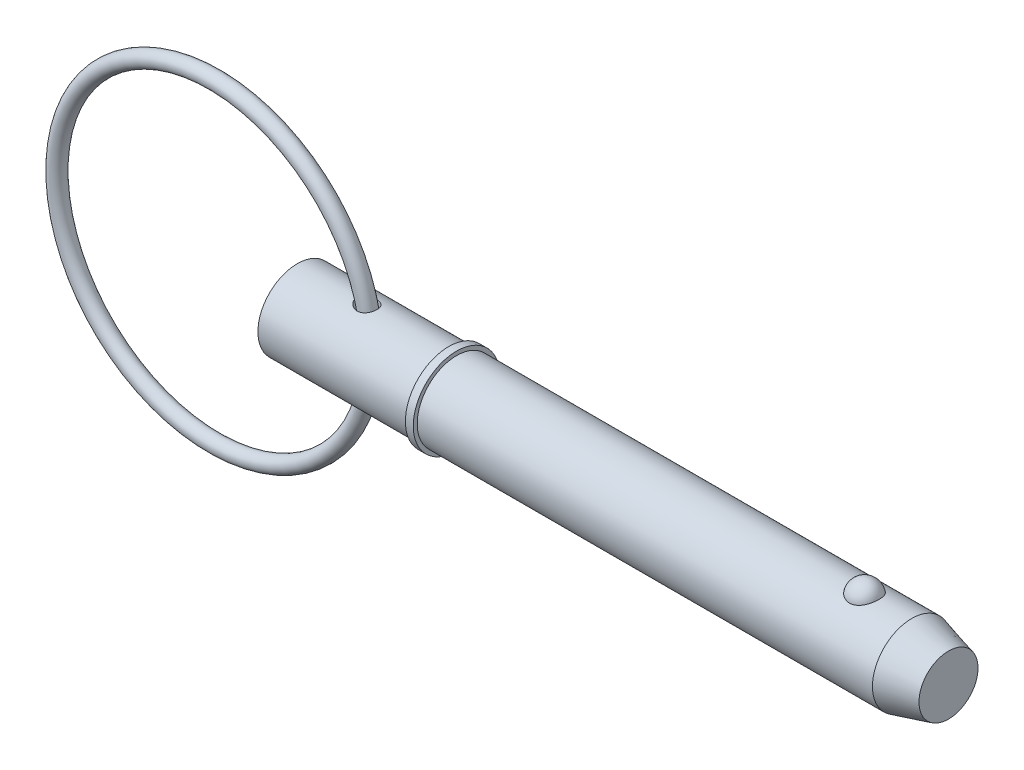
ISO-10303-21;
HEADER;
FILE_DESCRIPTION(('STEP AP214'),'2;1');
FILE_NAME('part.step','',(''),(''),'','','');
FILE_SCHEMA(('AUTOMOTIVE_DESIGN { 1 0 10303 214 1 1 1 1 }'));
ENDSEC;
DATA;
#1=APPLICATION_CONTEXT('core data for automotive mechanical design processes');
#2=APPLICATION_PROTOCOL_DEFINITION('international standard','automotive_design',2000,#1);
#3=PRODUCT_CONTEXT('',#1,'mechanical');
#4=PRODUCT('Part','Part','',(#3));
#5=PRODUCT_RELATED_PRODUCT_CATEGORY('part','',(#4));
#6=PRODUCT_DEFINITION_FORMATION('','',#4);
#7=PRODUCT_DEFINITION_CONTEXT('part definition',#1,'design');
#8=PRODUCT_DEFINITION('design','',#6,#7);
#9=PRODUCT_DEFINITION_SHAPE('','',#8);
#10=(LENGTH_UNIT() NAMED_UNIT(*) SI_UNIT(.MILLI.,.METRE.));
#11=(NAMED_UNIT(*) PLANE_ANGLE_UNIT() SI_UNIT($,.RADIAN.));
#12=(NAMED_UNIT(*) SI_UNIT($,.STERADIAN.) SOLID_ANGLE_UNIT());
#13=UNCERTAINTY_MEASURE_WITH_UNIT(LENGTH_MEASURE(1.E-05),#10,'distance_accuracy_value','');
#14=(GEOMETRIC_REPRESENTATION_CONTEXT(3) GLOBAL_UNCERTAINTY_ASSIGNED_CONTEXT((#13)) GLOBAL_UNIT_ASSIGNED_CONTEXT((#10,
#11,#12)) REPRESENTATION_CONTEXT('',''));
#15=CARTESIAN_POINT('',(0.,0.,0.));
#16=DIRECTION('',(0.,0.,1.));
#17=DIRECTION('',(1.,0.,0.));
#18=AXIS2_PLACEMENT_3D('',#15,#16,#17);
#19=CARTESIAN_POINT('',(-13.3798047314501,0.,0.));
#20=DIRECTION('',(0.,0.,1.));
#21=DIRECTION('',(1.,0.,0.));
#22=AXIS2_PLACEMENT_3D('',#19,#20,#21);
#23=TOROIDAL_SURFACE('',#22,25.4,1.27);
#24=CARTESIAN_POINT('',(13.2901952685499,0.,0.));
#25=VERTEX_POINT('',#24);
#26=VERTEX_LOOP('',#25);
#27=FACE_BOUND('',#26,.T.);
#28=ADVANCED_FACE('P0_F12',(#27),#23,.T.);
#29=CLOSED_SHELL('',(#28));
#30=MANIFOLD_SOLID_BREP('P0_B1',#29);
#31=CARTESIAN_POINT('',(0.,0.,0.));
#32=DIRECTION('',(1.,0.,0.));
#33=DIRECTION('',(0.,0.,-1.));
#34=AXIS2_PLACEMENT_3D('',#31,#32,#33);
#35=CYLINDRICAL_SURFACE('',#34,6.35);
#36=CARTESIAN_POINT('',(9.67500140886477,6.32698634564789,-0.540133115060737));
#37=CARTESIAN_POINT('',(9.70878953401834,6.3197498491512,-0.624879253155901));
#38=CARTESIAN_POINT('',(9.75028044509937,6.31105328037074,-0.706504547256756));
#39=CARTESIAN_POINT('',(9.84659255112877,6.29180070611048,-0.861319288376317));
#40=CARTESIAN_POINT('',(9.90144039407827,6.28124099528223,-0.934491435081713));
#41=CARTESIAN_POINT('',(10.021999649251,6.25949497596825,-1.0704877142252));
#42=CARTESIAN_POINT('',(10.0876589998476,6.2483118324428,-1.13335868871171));
#43=CARTESIAN_POINT('',(10.2280180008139,6.22641783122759,-1.24805262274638));
#44=CARTESIAN_POINT('',(10.3027159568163,6.21570688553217,-1.29987764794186));
#45=CARTESIAN_POINT('',(10.4650889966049,6.19509606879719,-1.39492899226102));
#46=CARTESIAN_POINT('',(10.5533142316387,6.1853135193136,-1.4372443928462));
#47=CARTESIAN_POINT('',(10.7357818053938,6.16871128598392,-1.50691441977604));
#48=CARTESIAN_POINT('',(10.8300253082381,6.16189217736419,-1.53426614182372));
#49=CARTESIAN_POINT('',(11.0227953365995,6.15211299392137,-1.57302798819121));
#50=CARTESIAN_POINT('',(11.1213511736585,6.14918579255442,-1.58430237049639));
#51=CARTESIAN_POINT('',(11.3189518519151,6.1478413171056,-1.58951619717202));
#52=CARTESIAN_POINT('',(11.417996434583,6.14942187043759,-1.58346399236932));
#53=CARTESIAN_POINT('',(11.6070859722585,6.15678569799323,-1.55457003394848));
#54=CARTESIAN_POINT('',(11.6973059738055,6.16229943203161,-1.53280404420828));
#55=CARTESIAN_POINT('',(11.8723373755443,6.17663058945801,-1.4739892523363));
#56=CARTESIAN_POINT('',(11.9571502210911,6.185447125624,-1.43694455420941));
#57=CARTESIAN_POINT('',(12.1146737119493,6.20482821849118,-1.35072170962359));
#58=CARTESIAN_POINT('',(12.1877743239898,6.21528554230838,-1.30222952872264));
#59=CARTESIAN_POINT('',(12.3246187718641,6.23705116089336,-1.19362916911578));
#60=CARTESIAN_POINT('',(12.3883628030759,6.24835943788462,-1.1335212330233));
#61=CARTESIAN_POINT('',(12.5046662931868,6.27053957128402,-1.00357204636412));
#62=CARTESIAN_POINT('',(12.5572571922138,6.28141258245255,-0.933759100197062));
#63=CARTESIAN_POINT('',(12.6502125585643,6.30157953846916,-0.786214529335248));
#64=CARTESIAN_POINT('',(12.6905764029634,6.31087340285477,-0.708482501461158));
#65=CARTESIAN_POINT('',(12.7585531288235,6.32699259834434,-0.546246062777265));
#66=CARTESIAN_POINT('',(12.7860022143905,6.33378599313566,-0.46166981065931));
#67=CARTESIAN_POINT('',(12.8267605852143,6.34401050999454,-0.288980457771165));
#68=CARTESIAN_POINT('',(12.8400695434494,6.34744155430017,-0.200867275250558));
#69=CARTESIAN_POINT('',(12.8522644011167,6.35058177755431,-0.023194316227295));
#70=CARTESIAN_POINT('',(12.8510870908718,6.35027464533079,0.0663700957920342));
#71=CARTESIAN_POINT('',(12.8341831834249,6.34593169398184,0.244024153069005));
#72=CARTESIAN_POINT('',(12.8184563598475,6.341895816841,0.332113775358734));
#73=CARTESIAN_POINT('',(12.7728208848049,6.33052992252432,0.504322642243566));
#74=CARTESIAN_POINT('',(12.7429114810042,6.32319973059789,0.58844167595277));
#75=CARTESIAN_POINT('',(12.6696162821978,6.30604116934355,0.750316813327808));
#76=CARTESIAN_POINT('',(12.6262302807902,6.29621276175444,0.828072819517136));
#77=CARTESIAN_POINT('',(12.5270856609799,6.27515240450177,0.974918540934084));
#78=CARTESIAN_POINT('',(12.4713403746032,6.26392197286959,1.04401746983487));
#79=CARTESIAN_POINT('',(12.3488662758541,6.24131002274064,1.1716478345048));
#80=CARTESIAN_POINT('',(12.2821384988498,6.22992851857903,1.23018026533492));
#81=CARTESIAN_POINT('',(12.1401870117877,6.20841765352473,1.33449214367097));
#82=CARTESIAN_POINT('',(12.0650507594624,6.19827734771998,1.38038832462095));
#83=CARTESIAN_POINT('',(11.9079044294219,6.18026478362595,1.45892404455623));
#84=CARTESIAN_POINT('',(11.8258951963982,6.17239224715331,1.49156520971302));
#85=CARTESIAN_POINT('',(11.6581736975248,6.15982613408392,1.54263810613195));
#86=CARTESIAN_POINT('',(11.572502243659,6.15510409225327,1.56119728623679));
#87=CARTESIAN_POINT('',(11.3991899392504,6.14916283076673,1.58443707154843));
#88=CARTESIAN_POINT('',(11.3115488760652,6.14794399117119,1.58911617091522));
#89=CARTESIAN_POINT('',(11.1345547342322,6.14904466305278,1.58485137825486));
#90=CARTESIAN_POINT('',(11.0452104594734,6.15144894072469,1.5755811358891));
#91=CARTESIAN_POINT('',(10.8691479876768,6.15957601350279,1.54349959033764));
#92=CARTESIAN_POINT('',(10.782430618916,6.16529984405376,1.52068406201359));
#93=CARTESIAN_POINT('',(10.6082848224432,6.17983892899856,1.4605156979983));
#94=CARTESIAN_POINT('',(10.5211557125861,6.1888262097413,1.42233764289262));
#95=CARTESIAN_POINT('',(10.3542377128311,6.20874782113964,1.33268652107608));
#96=CARTESIAN_POINT('',(10.2744521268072,6.21968302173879,1.28120750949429));
#97=CARTESIAN_POINT('',(10.120854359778,6.24282707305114,1.16334748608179));
#98=CARTESIAN_POINT('',(10.0474902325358,6.25507146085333,1.09638652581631));
#99=CARTESIAN_POINT('',(9.9136869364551,6.27890019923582,0.950453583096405));
#100=CARTESIAN_POINT('',(9.85324511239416,6.29048468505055,0.871484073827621));
#101=CARTESIAN_POINT('',(9.75037543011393,6.31102161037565,0.707140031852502));
#102=CARTESIAN_POINT('',(9.70726585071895,6.32006820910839,0.622206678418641));
#103=CARTESIAN_POINT('',(9.63775895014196,6.33497125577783,0.445490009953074));
#104=CARTESIAN_POINT('',(9.61134627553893,6.34083063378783,0.35371307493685));
#105=CARTESIAN_POINT('',(9.57891955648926,6.34807071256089,0.177220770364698));
#106=CARTESIAN_POINT('',(9.57093524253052,6.3498832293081,0.0928817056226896));
#107=CARTESIAN_POINT('',(9.56994851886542,6.35010532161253,-0.0758268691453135));
#108=CARTESIAN_POINT('',(9.57692695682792,6.34851924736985,-0.160196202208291));
#109=CARTESIAN_POINT('',(9.59985709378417,6.34339435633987,-0.294043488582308));
#110=CARTESIAN_POINT('',(9.61128951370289,6.34084912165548,-0.344385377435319));
#111=CARTESIAN_POINT('',(9.63933183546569,6.33468615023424,-0.443526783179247));
#112=CARTESIAN_POINT('',(9.65594100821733,6.33106856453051,-0.492326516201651));
#113=CARTESIAN_POINT('',(9.67500140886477,6.32698634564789,-0.540133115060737));
#114=B_SPLINE_CURVE_WITH_KNOTS('',3,(#36,#37,#38,#39,#40,#41,#42,#43,#44,#45,#46,#47,#48,#49,
#50,#51,#52,#53,#54,#55,#56,#57,#58,#59,#60,#61,#62,#63,#64,#65,#66,#67,#68,#69,#70,#71,#72,#73,
#74,#75,#76,#77,#78,#79,#80,#81,#82,#83,#84,#85,#86,#87,#88,#89,#90,#91,#92,#93,#94,#95,#96,#97,
#98,#99,#100,#101,#102,#103,#104,#105,#106,#107,#108,#109,#110,#111,#112,#113),.UNSPECIFIED.,
.T.,.F.,(4,2,2,2,2,2,2,2,2,2,2,2,2,2,2,2,2,2,2,2,2,2,2,2,2,2,2,2,2,2,2,2,2,2,2,2,2,2,4),(0.,
0.274348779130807,0.549249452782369,0.822863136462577,1.09642560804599,1.39007706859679,
1.68378550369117,1.97995934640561,2.27599046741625,2.55347281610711,2.83088067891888,
3.09465189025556,3.35841759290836,3.62142956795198,3.88445494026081,4.1507318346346,
4.4170148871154,4.68446025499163,4.95190978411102,5.21937350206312,5.48684131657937,
5.75402200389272,6.02117751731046,6.28577524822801,6.55034050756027,6.81248178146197,
7.0746514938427,7.34305086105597,7.61153399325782,7.89692981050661,8.18245340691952,
8.48120635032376,8.77989784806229,9.06530254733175,9.35044442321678,9.60331609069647,
9.85586427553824,10.010650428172,10.1654147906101),.UNSPECIFIED.);
#115=CARTESIAN_POINT('',(9.67500140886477,6.32698634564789,-0.540133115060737));
#116=VERTEX_POINT('',#115);
#117=EDGE_CURVE('P1_E42',#116,#116,#114,.T.);
#118=ORIENTED_EDGE('',*,*,#117,.T.);
#119=EDGE_LOOP('',(#118));
#120=FACE_BOUND('',#119,.T.);
#121=CARTESIAN_POINT('',(0.,0.,0.));
#122=DIRECTION('',(1.,0.,0.));
#123=DIRECTION('',(0.,0.,-1.));
#124=AXIS2_PLACEMENT_3D('',#121,#122,#123);
#125=CIRCLE('',#124,6.35);
#126=CARTESIAN_POINT('',(0.,0.,-6.35));
#127=VERTEX_POINT('',#126);
#128=EDGE_CURVE('P1_E9',#127,#127,#125,.T.);
#129=ORIENTED_EDGE('',*,*,#128,.T.);
#130=EDGE_LOOP('',(#129));
#131=FACE_BOUND('',#130,.T.);
#132=CARTESIAN_POINT('',(24.43,0.,0.));
#133=DIRECTION('',(1.,0.,0.));
#134=DIRECTION('',(0.,0.,-1.));
#135=AXIS2_PLACEMENT_3D('',#132,#133,#134);
#136=CIRCLE('',#135,6.35);
#137=CARTESIAN_POINT('',(24.43,0.,-6.35));
#138=VERTEX_POINT('',#137);
#139=EDGE_CURVE('P1_E25',#138,#138,#136,.T.);
#140=ORIENTED_EDGE('',*,*,#139,.F.);
#141=EDGE_LOOP('',(#140));
#142=FACE_BOUND('',#141,.T.);
#143=CARTESIAN_POINT('',(9.67500140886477,-6.32698634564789,-0.540133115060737));
#144=CARTESIAN_POINT('',(9.64544894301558,-6.33331515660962,-0.466002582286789));
#145=CARTESIAN_POINT('',(9.62177180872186,-6.33852974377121,-0.389437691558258));
#146=CARTESIAN_POINT('',(9.58727043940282,-6.34619174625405,-0.233330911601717));
#147=CARTESIAN_POINT('',(9.57644043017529,-6.34864040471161,-0.153790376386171));
#148=CARTESIAN_POINT('',(9.56819517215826,-6.3505010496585,0.00612071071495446));
#149=CARTESIAN_POINT('',(9.57079639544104,-6.34990930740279,0.0864921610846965));
#150=CARTESIAN_POINT('',(9.58930797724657,-6.3457478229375,0.245607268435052));
#151=CARTESIAN_POINT('',(9.60522046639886,-6.34217760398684,0.324350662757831));
#152=CARTESIAN_POINT('',(9.64931570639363,-6.3324977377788,0.47727605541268));
#153=CARTESIAN_POINT('',(9.67737525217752,-6.32641361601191,0.551495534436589));
#154=CARTESIAN_POINT('',(9.74451510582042,-6.31231128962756,0.694551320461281));
#155=CARTESIAN_POINT('',(9.78359827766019,-6.30429258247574,0.763386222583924));
#156=CARTESIAN_POINT('',(9.87474700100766,-6.28638332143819,0.899414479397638));
#157=CARTESIAN_POINT('',(9.92757481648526,-6.27639669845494,0.966083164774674));
#158=CARTESIAN_POINT('',(10.042675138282,-6.25596164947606,1.09061181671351));
#159=CARTESIAN_POINT('',(10.1049521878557,-6.24551300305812,1.14846751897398));
#160=CARTESIAN_POINT('',(10.2445505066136,-6.22397505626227,1.26024641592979));
#161=CARTESIAN_POINT('',(10.3227711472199,-6.2129394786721,1.31305951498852));
#162=CARTESIAN_POINT('',(10.4867924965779,-6.19263757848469,1.40570084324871));
#163=CARTESIAN_POINT('',(10.5725962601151,-6.18337197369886,1.44552380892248));
#164=CARTESIAN_POINT('',(10.7543302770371,-6.16725983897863,1.51283687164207));
#165=CARTESIAN_POINT('',(10.8505554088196,-6.16056505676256,1.53957358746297));
#166=CARTESIAN_POINT('',(11.0463546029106,-6.15127671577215,1.57628137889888));
#167=CARTESIAN_POINT('',(11.1459276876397,-6.14868197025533,1.58625730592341));
#168=CARTESIAN_POINT('',(11.3414257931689,-6.14810798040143,1.58848000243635));
#169=CARTESIAN_POINT('',(11.4373417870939,-6.14995283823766,1.58140242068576));
#170=CARTESIAN_POINT('',(11.6262783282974,-6.1577972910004,1.55057566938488));
#171=CARTESIAN_POINT('',(11.719300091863,-6.16379511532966,1.52683360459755));
#172=CARTESIAN_POINT('',(11.8934223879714,-6.17873566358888,1.46514575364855));
#173=CARTESIAN_POINT('',(11.9749048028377,-6.18746207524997,1.42822144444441));
#174=CARTESIAN_POINT('',(12.1301362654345,-6.20693584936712,1.3410564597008));
#175=CARTESIAN_POINT('',(12.2038861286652,-6.21768299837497,1.29081719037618));
#176=CARTESIAN_POINT('',(12.3399792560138,-6.23970077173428,1.17972764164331));
#177=CARTESIAN_POINT('',(12.4025430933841,-6.25095401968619,1.11914355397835));
#178=CARTESIAN_POINT('',(12.5166805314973,-6.27296916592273,0.988307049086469));
#179=CARTESIAN_POINT('',(12.568253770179,-6.28373104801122,0.918054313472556));
#180=CARTESIAN_POINT('',(12.6596230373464,-6.3037060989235,0.769081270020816));
#181=CARTESIAN_POINT('',(12.6992956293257,-6.31290263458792,0.690283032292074));
#182=CARTESIAN_POINT('',(12.7652258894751,-6.32862394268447,0.527011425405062));
#183=CARTESIAN_POINT('',(12.7914829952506,-6.33514860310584,0.442537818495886));
#184=CARTESIAN_POINT('',(12.8301436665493,-6.34487485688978,0.269505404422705));
#185=CARTESIAN_POINT('',(12.8424230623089,-6.34804664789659,0.180917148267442));
#186=CARTESIAN_POINT('',(12.8524214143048,-6.35062347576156,0.00286829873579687));
#187=CARTESIAN_POINT('',(12.8501402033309,-6.35002846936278,-0.0865923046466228));
#188=CARTESIAN_POINT('',(12.8310619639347,-6.34513332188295,-0.263931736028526));
#189=CARTESIAN_POINT('',(12.8142517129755,-6.34082980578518,-0.35180904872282));
#190=CARTESIAN_POINT('',(12.7664911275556,-6.32897674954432,-0.523406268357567));
#191=CARTESIAN_POINT('',(12.7355404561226,-6.3214271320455,-0.607126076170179));
#192=CARTESIAN_POINT('',(12.6602298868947,-6.30390232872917,-0.768030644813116));
#193=CARTESIAN_POINT('',(12.6158695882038,-6.29392707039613,-0.84521521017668));
#194=CARTESIAN_POINT('',(12.5148171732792,-6.2726521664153,-0.990836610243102));
#195=CARTESIAN_POINT('',(12.4581254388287,-6.26135256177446,-1.05927371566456));
#196=CARTESIAN_POINT('',(12.33416419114,-6.2387572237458,-1.18510935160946));
#197=CARTESIAN_POINT('',(12.2669484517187,-6.22746174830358,-1.24256086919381));
#198=CARTESIAN_POINT('',(12.1235592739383,-6.20610255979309,-1.34519464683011));
#199=CARTESIAN_POINT('',(12.0473871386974,-6.19603866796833,-1.39037868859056));
#200=CARTESIAN_POINT('',(11.8892714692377,-6.17839642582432,-1.46678006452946));
#201=CARTESIAN_POINT('',(11.8074126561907,-6.17078838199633,-1.49816605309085));
#202=CARTESIAN_POINT('',(11.6394563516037,-6.15869606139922,-1.54712759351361));
#203=CARTESIAN_POINT('',(11.5533589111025,-6.15421174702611,-1.56470331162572));
#204=CARTESIAN_POINT('',(11.3789660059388,-6.14876652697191,-1.58596734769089));
#205=CARTESIAN_POINT('',(11.2906621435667,-6.1478222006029,-1.58959032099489));
#206=CARTESIAN_POINT('',(11.1146029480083,-6.149490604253,-1.58312110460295));
#207=CARTESIAN_POINT('',(11.0268477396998,-6.1521041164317,-1.57302589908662));
#208=CARTESIAN_POINT('',(10.8498668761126,-6.16071031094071,-1.53898332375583));
#209=CARTESIAN_POINT('',(10.7607726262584,-6.16685908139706,-1.51439468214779));
#210=CARTESIAN_POINT('',(10.5876521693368,-6.18189031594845,-1.45181305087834));
#211=CARTESIAN_POINT('',(10.5036282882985,-6.19077402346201,-1.41381396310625));
#212=CARTESIAN_POINT('',(10.3374228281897,-6.2109378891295,-1.32252480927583));
#213=CARTESIAN_POINT('',(10.255708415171,-6.2223355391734,-1.26840756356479));
#214=CARTESIAN_POINT('',(10.1025645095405,-6.24580740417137,-1.14725208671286));
#215=CARTESIAN_POINT('',(10.0311354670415,-6.25788164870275,-1.08021329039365));
#216=CARTESIAN_POINT('',(9.90472699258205,-6.2806176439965,-0.938710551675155));
#217=CARTESIAN_POINT('',(9.84904456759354,-6.29132066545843,-0.864883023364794));
#218=CARTESIAN_POINT('',(9.75129345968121,-6.31084098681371,-0.708496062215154));
#219=CARTESIAN_POINT('',(9.70921094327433,-6.31966019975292,-0.625945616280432));
#220=CARTESIAN_POINT('',(9.67500140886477,-6.32698634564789,-0.540133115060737));
#221=B_SPLINE_CURVE_WITH_KNOTS('',3,(#143,#144,#145,#146,#147,#148,#149,#150,#151,#152,#153,
#154,#155,#156,#157,#158,#159,#160,#161,#162,#163,#164,#165,#166,#167,#168,#169,#170,#171,#172,
#173,#174,#175,#176,#177,#178,#179,#180,#181,#182,#183,#184,#185,#186,#187,#188,#189,#190,#191,
#192,#193,#194,#195,#196,#197,#198,#199,#200,#201,#202,#203,#204,#205,#206,#207,#208,#209,#210,
#211,#212,#213,#214,#215,#216,#217,#218,#219,#220),.UNSPECIFIED.,.T.,.F.,(4,2,2,2,2,2,2,2,2,2,2,
2,2,2,2,2,2,2,2,2,2,2,2,2,2,2,2,2,2,2,2,2,2,2,2,2,2,2,4),(0.,0.239871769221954,
0.479635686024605,0.719693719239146,0.959790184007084,1.19750645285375,1.43528453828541,
1.69117930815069,1.94719750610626,2.23102979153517,2.51497694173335,2.81376497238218,
3.11246650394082,3.39952951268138,3.68647020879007,3.95479420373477,4.22308987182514,
4.48530700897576,4.74753278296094,5.01239119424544,5.27726070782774,5.54446524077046,
5.81167284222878,6.07912387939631,6.34658129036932,6.61404669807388,6.88150382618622,
7.14763644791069,7.41373039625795,7.67647472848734,7.93921589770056,8.20318607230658,
8.46721428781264,8.74390821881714,9.02072813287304,9.31537622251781,9.61003720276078,
9.88799314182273,10.1656654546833),.UNSPECIFIED.);
#222=CARTESIAN_POINT('',(9.67500140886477,-6.32698634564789,-0.540133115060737));
#223=VERTEX_POINT('',#222);
#224=EDGE_CURVE('P1_E17',#223,#223,#221,.T.);
#225=ORIENTED_EDGE('',*,*,#224,.T.);
#226=EDGE_LOOP('',(#225));
#227=FACE_BOUND('',#226,.T.);
#228=ADVANCED_FACE('P1_F13',(#120,#131,#142,#227),#35,.T.);
#229=CARTESIAN_POINT('',(0.,0.,0.));
#230=DIRECTION('',(1.,0.,0.));
#231=DIRECTION('',(0.,0.,-1.));
#232=AXIS2_PLACEMENT_3D('',#229,#230,#231);
#233=CYLINDRICAL_SURFACE('',#232,6.35);
#234=CARTESIAN_POINT('',(99.1553693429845,0.,0.));
#235=DIRECTION('',(1.,0.,0.));
#236=DIRECTION('',(0.,0.,-1.));
#237=AXIS2_PLACEMENT_3D('',#234,#235,#236);
#238=CIRCLE('',#237,6.35);
#239=CARTESIAN_POINT('',(99.1553693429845,0.,-6.35));
#240=VERTEX_POINT('',#239);
#241=EDGE_CURVE('P1_E99',#240,#240,#238,.T.);
#242=ORIENTED_EDGE('',*,*,#241,.F.);
#243=EDGE_LOOP('',(#242));
#244=FACE_BOUND('',#243,.T.);
#245=CARTESIAN_POINT('',(25.7,0.,0.));
#246=DIRECTION('',(1.,0.,0.));
#247=DIRECTION('',(0.,0.,-1.));
#248=AXIS2_PLACEMENT_3D('',#245,#246,#247);
#249=CIRCLE('',#248,6.35);
#250=CARTESIAN_POINT('',(25.7,0.,-6.35));
#251=VERTEX_POINT('',#250);
#252=EDGE_CURVE('P1_E96',#251,#251,#249,.T.);
#253=ORIENTED_EDGE('',*,*,#252,.T.);
#254=EDGE_LOOP('',(#253));
#255=FACE_BOUND('',#254,.T.);
#256=CARTESIAN_POINT('',(91.5300214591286,5.87502187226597,2.40969251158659));
#257=CARTESIAN_POINT('',(91.4050305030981,5.87501645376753,2.40969773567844));
#258=CARTESIAN_POINT('',(91.2800806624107,5.87916061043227,2.39967292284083));
#259=CARTESIAN_POINT('',(91.0339091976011,5.8952311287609,2.3599173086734));
#260=CARTESIAN_POINT('',(90.9126863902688,5.90715499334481,2.33019283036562));
#261=CARTESIAN_POINT('',(90.6775170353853,5.93739567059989,2.25201402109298));
#262=CARTESIAN_POINT('',(90.5635602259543,5.95570321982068,2.2035868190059));
#263=CARTESIAN_POINT('',(90.3455735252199,5.99672067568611,2.08937987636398));
#264=CARTESIAN_POINT('',(90.2415457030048,6.01943149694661,2.02359652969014));
#265=CARTESIAN_POINT('',(90.0429437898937,6.06760647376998,1.87428969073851));
#266=CARTESIAN_POINT('',(89.9487268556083,6.09313095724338,1.79031110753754));
#267=CARTESIAN_POINT('',(89.7752557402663,6.14375873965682,1.60800178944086));
#268=CARTESIAN_POINT('',(89.6960043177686,6.16886196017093,1.50966841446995));
#269=CARTESIAN_POINT('',(89.5508457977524,6.21724600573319,1.29645884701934));
#270=CARTESIAN_POINT('',(89.4856885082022,6.24039621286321,1.18104158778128));
#271=CARTESIAN_POINT('',(89.3747035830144,6.28117277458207,0.940351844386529));
#272=CARTESIAN_POINT('',(89.3288776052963,6.29879865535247,0.815078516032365));
#273=CARTESIAN_POINT('',(89.2570234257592,6.32692073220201,0.556494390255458));
#274=CARTESIAN_POINT('',(89.231249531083,6.33732517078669,0.423102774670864));
#275=CARTESIAN_POINT('',(89.2009885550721,6.34957673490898,0.153542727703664));
#276=CARTESIAN_POINT('',(89.1965009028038,6.35142408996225,0.0173743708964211));
#277=CARTESIAN_POINT('',(89.2088655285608,6.34638925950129,-0.253036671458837));
#278=CARTESIAN_POINT('',(89.2255949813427,6.33955731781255,-0.387285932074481));
#279=CARTESIAN_POINT('',(89.279843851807,6.31794129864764,-0.65085123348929));
#280=CARTESIAN_POINT('',(89.3173636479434,6.30315707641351,-0.780167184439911));
#281=CARTESIAN_POINT('',(89.412500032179,6.26711642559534,-1.03041949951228));
#282=CARTESIAN_POINT('',(89.470143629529,6.24585130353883,-1.15134433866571));
#283=CARTESIAN_POINT('',(89.6043522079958,6.19905619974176,-1.38129800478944));
#284=CARTESIAN_POINT('',(89.680918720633,6.17352587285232,-1.49032586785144));
#285=CARTESIAN_POINT('',(89.8517538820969,6.12080227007,-1.69393164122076));
#286=CARTESIAN_POINT('',(89.9461008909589,6.09360200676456,-1.78844209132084));
#287=CARTESIAN_POINT('',(90.1501196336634,6.04070434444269,-1.95970536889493));
#288=CARTESIAN_POINT('',(90.2597900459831,6.01500681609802,-2.03645972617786));
#289=CARTESIAN_POINT('',(90.4891876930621,5.96867714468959,-2.1684564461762));
#290=CARTESIAN_POINT('',(90.6086522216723,5.94794910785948,-2.2241206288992));
#291=CARTESIAN_POINT('',(90.8562188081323,5.91340580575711,-2.31440992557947));
#292=CARTESIAN_POINT('',(90.9843175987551,5.89958794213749,-2.3490429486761));
#293=CARTESIAN_POINT('',(91.238582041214,5.88111049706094,-2.39491590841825));
#294=CARTESIAN_POINT('',(91.3645207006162,5.876025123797,-2.40724512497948));
#295=CARTESIAN_POINT('',(91.6167867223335,5.87428980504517,-2.41147867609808));
#296=CARTESIAN_POINT('',(91.743114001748,5.87763817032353,-2.40338710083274));
#297=CARTESIAN_POINT('',(91.9884170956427,5.89212921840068,-2.36762715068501));
#298=CARTESIAN_POINT('',(92.1074992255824,5.90302431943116,-2.34058030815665));
#299=CARTESIAN_POINT('',(92.3392447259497,5.93113752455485,-2.26839066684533));
#300=CARTESIAN_POINT('',(92.4519075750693,5.94835614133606,-2.2232464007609));
#301=CARTESIAN_POINT('',(92.6704009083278,5.98773016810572,-2.11493806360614));
#302=CARTESIAN_POINT('',(92.776028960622,6.00998499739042,-2.05140269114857));
#303=CARTESIAN_POINT('',(92.9753006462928,6.05690144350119,-1.90842705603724));
#304=CARTESIAN_POINT('',(93.0689415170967,6.08156361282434,-1.8289831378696));
#305=CARTESIAN_POINT('',(93.2466754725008,6.13211715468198,-1.65182429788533));
#306=CARTESIAN_POINT('',(93.330055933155,6.15800825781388,-1.55339381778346));
#307=CARTESIAN_POINT('',(93.4797900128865,6.20712834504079,-1.34374214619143));
#308=CARTESIAN_POINT('',(93.5461405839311,6.23035685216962,-1.23251867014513));
#309=CARTESIAN_POINT('',(93.6623455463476,6.27251177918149,-0.996447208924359));
#310=CARTESIAN_POINT('',(93.7116072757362,6.29127762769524,-0.871278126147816));
#311=CARTESIAN_POINT('',(93.7896142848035,6.3215862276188,-0.613870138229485));
#312=CARTESIAN_POINT('',(93.818359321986,6.33312889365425,-0.481631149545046));
#313=CARTESIAN_POINT('',(93.8547705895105,6.34782349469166,-0.213672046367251));
#314=CARTESIAN_POINT('',(93.8624134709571,6.35096613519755,-0.0779482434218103));
#315=CARTESIAN_POINT('',(93.8563951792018,6.34851322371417,0.19294395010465));
#316=CARTESIAN_POINT('',(93.8427343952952,6.3429178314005,0.328112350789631));
#317=CARTESIAN_POINT('',(93.7945036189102,6.32360512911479,0.593406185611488));
#318=CARTESIAN_POINT('',(93.7600313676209,6.30992579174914,0.723552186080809));
#319=CARTESIAN_POINT('',(93.6709539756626,6.27586325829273,0.975834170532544));
#320=CARTESIAN_POINT('',(93.6163476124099,6.25547965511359,1.09796966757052));
#321=CARTESIAN_POINT('',(93.4877587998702,6.20998183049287,1.33148921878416));
#322=CARTESIAN_POINT('',(93.4136742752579,6.18484288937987,1.44281227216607));
#323=CARTESIAN_POINT('',(93.2478204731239,6.13258735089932,1.65087683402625));
#324=CARTESIAN_POINT('',(93.1560515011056,6.10547078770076,1.74761859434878));
#325=CARTESIAN_POINT('',(92.9571839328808,6.0523587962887,1.92350926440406));
#326=CARTESIAN_POINT('',(92.850133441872,6.0263601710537,2.00271146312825));
#327=CARTESIAN_POINT('',(92.6231384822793,5.97843747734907,2.14154159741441));
#328=CARTESIAN_POINT('',(92.503191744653,5.95651412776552,2.20116608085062));
#329=CARTESIAN_POINT('',(92.2445236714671,5.91812106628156,2.30250570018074));
#330=CARTESIAN_POINT('',(92.1050698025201,5.90217533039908,2.34256795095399));
#331=CARTESIAN_POINT('',(91.8203974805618,5.88063128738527,2.39615214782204));
#332=CARTESIAN_POINT('',(91.6751817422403,5.8750281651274,2.40968644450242));
#333=CARTESIAN_POINT('',(91.5300214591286,5.87502187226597,2.40969251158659));
#334=B_SPLINE_CURVE_WITH_KNOTS('',3,(#256,#257,#258,#259,#260,#261,#262,#263,#264,#265,#266,
#267,#268,#269,#270,#271,#272,#273,#274,#275,#276,#277,#278,#279,#280,#281,#282,#283,#284,#285,
#286,#287,#288,#289,#290,#291,#292,#293,#294,#295,#296,#297,#298,#299,#300,#301,#302,#303,#304,
#305,#306,#307,#308,#309,#310,#311,#312,#313,#314,#315,#316,#317,#318,#319,#320,#321,#322,#323,
#324,#325,#326,#327,#328,#329,#330,#331,#332,#333),.UNSPECIFIED.,.T.,.F.,(4,2,2,2,2,2,2,2,2,2,2,
2,2,2,2,2,2,2,2,2,2,2,2,2,2,2,2,2,2,2,2,2,2,2,2,2,2,2,4),(0.,0.374440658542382,
0.748761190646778,1.12254078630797,1.49639810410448,1.88098871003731,2.26565013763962,
2.66741104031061,3.06920639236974,3.47601794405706,3.88281858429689,4.28727498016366,
4.69173873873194,5.09674745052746,5.50178895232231,5.90865911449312,6.31549420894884,
6.71369855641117,7.11175305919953,7.48978077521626,7.86773278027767,8.2338388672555,
8.59997464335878,8.97409044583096,9.34829231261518,9.74122667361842,10.1342313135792,
10.5397522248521,10.9452779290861,11.3512521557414,11.7572189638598,12.1612938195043,
12.5653932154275,12.9716540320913,13.3779078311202,13.7829098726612,14.1879832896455,
14.6230486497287,15.0579114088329),.UNSPECIFIED.);
#335=CARTESIAN_POINT('',(91.5300214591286,5.87502187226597,2.40969251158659));
#336=VERTEX_POINT('',#335);
#337=EDGE_CURVE('P1_E34',#336,#336,#334,.T.);
#338=ORIENTED_EDGE('',*,*,#337,.T.);
#339=EDGE_LOOP('',(#338));
#340=FACE_BOUND('',#339,.T.);
#341=ADVANCED_FACE('P1_F46',(#244,#255,#340),#233,.T.);
#342=CARTESIAN_POINT('',(0.,0.,0.));
#343=DIRECTION('',(-1.,0.,0.));
#344=DIRECTION('',(0.,0.,1.));
#345=AXIS2_PLACEMENT_3D('',#342,#343,#344);
#346=PLANE('',#345);
#347=ORIENTED_EDGE('',*,*,#128,.F.);
#348=EDGE_LOOP('',(#347));
#349=FACE_BOUND('',#348,.T.);
#350=ADVANCED_FACE('P1_F15',(#349),#346,.T.);
#351=CARTESIAN_POINT('',(24.43,6.35,0.));
#352=DIRECTION('',(-1.,0.,0.));
#353=DIRECTION('',(0.,0.,1.));
#354=AXIS2_PLACEMENT_3D('',#351,#352,#353);
#355=PLANE('',#354);
#356=ORIENTED_EDGE('',*,*,#139,.T.);
#357=EDGE_LOOP('',(#356));
#358=FACE_BOUND('',#357,.T.);
#359=CARTESIAN_POINT('',(24.43,0.,0.));
#360=DIRECTION('',(1.,0.,0.));
#361=DIRECTION('',(0.,0.,-1.));
#362=AXIS2_PLACEMENT_3D('',#359,#360,#361);
#363=CIRCLE('',#362,6.985);
#364=CARTESIAN_POINT('',(24.43,0.,-6.985));
#365=VERTEX_POINT('',#364);
#366=EDGE_CURVE('P1_E30',#365,#365,#363,.T.);
#367=ORIENTED_EDGE('',*,*,#366,.F.);
#368=EDGE_LOOP('',(#367));
#369=FACE_BOUND('',#368,.T.);
#370=ADVANCED_FACE('P1_F81',(#358,#369),#355,.T.);
#371=CARTESIAN_POINT('',(0.,0.,0.));
#372=DIRECTION('',(1.,0.,0.));
#373=DIRECTION('',(0.,0.,-1.));
#374=AXIS2_PLACEMENT_3D('',#371,#372,#373);
#375=CYLINDRICAL_SURFACE('',#374,6.985);
#376=ORIENTED_EDGE('',*,*,#366,.T.);
#377=EDGE_LOOP('',(#376));
#378=FACE_BOUND('',#377,.T.);
#379=CARTESIAN_POINT('',(25.7,0.,0.));
#380=DIRECTION('',(1.,0.,0.));
#381=DIRECTION('',(0.,0.,-1.));
#382=AXIS2_PLACEMENT_3D('',#379,#380,#381);
#383=CIRCLE('',#382,6.985);
#384=CARTESIAN_POINT('',(25.7,0.,-6.985));
#385=VERTEX_POINT('',#384);
#386=EDGE_CURVE('P1_E95',#385,#385,#383,.T.);
#387=ORIENTED_EDGE('',*,*,#386,.F.);
#388=EDGE_LOOP('',(#387));
#389=FACE_BOUND('',#388,.T.);
#390=ADVANCED_FACE('P1_F68',(#378,#389),#375,.T.);
#391=CARTESIAN_POINT('',(25.7,6.985,0.));
#392=DIRECTION('',(1.,0.,0.));
#393=DIRECTION('',(0.,0.,-1.));
#394=AXIS2_PLACEMENT_3D('',#391,#392,#393);
#395=PLANE('',#394);
#396=ORIENTED_EDGE('',*,*,#386,.T.);
#397=EDGE_LOOP('',(#396));
#398=FACE_BOUND('',#397,.T.);
#399=ORIENTED_EDGE('',*,*,#252,.F.);
#400=EDGE_LOOP('',(#399));
#401=FACE_BOUND('',#400,.T.);
#402=ADVANCED_FACE('P1_F62',(#398,#401),#395,.T.);
#403=CARTESIAN_POINT('',(105.08,0.,0.));
#404=DIRECTION('',(-1.,0.,0.));
#405=DIRECTION('',(0.,0.,1.));
#406=AXIS2_PLACEMENT_3D('',#403,#404,#405);
#407=CONICAL_SURFACE('',#406,4.76250000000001,0.26179938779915);
#408=ORIENTED_EDGE('',*,*,#241,.T.);
#409=EDGE_LOOP('',(#408));
#410=FACE_BOUND('',#409,.T.);
#411=CARTESIAN_POINT('',(105.08,0.,0.));
#412=DIRECTION('',(1.,0.,0.));
#413=DIRECTION('',(0.,0.,-1.));
#414=AXIS2_PLACEMENT_3D('',#411,#412,#413);
#415=CIRCLE('',#414,4.76250000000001);
#416=CARTESIAN_POINT('',(105.08,0.,-4.76250000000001));
#417=VERTEX_POINT('',#416);
#418=EDGE_CURVE('P1_E41',#417,#417,#415,.T.);
#419=ORIENTED_EDGE('',*,*,#418,.F.);
#420=EDGE_LOOP('',(#419));
#421=FACE_BOUND('',#420,.T.);
#422=ADVANCED_FACE('P1_F59',(#410,#421),#407,.T.);
#423=CARTESIAN_POINT('',(105.08,4.76250000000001,0.));
#424=DIRECTION('',(1.,0.,0.));
#425=DIRECTION('',(0.,0.,-1.));
#426=AXIS2_PLACEMENT_3D('',#423,#424,#425);
#427=PLANE('',#426);
#428=ORIENTED_EDGE('',*,*,#418,.T.);
#429=EDGE_LOOP('',(#428));
#430=FACE_BOUND('',#429,.T.);
#431=ADVANCED_FACE('P1_F55',(#430),#427,.T.);
#432=CARTESIAN_POINT('',(91.5300214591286,5.715,0.));
#433=DIRECTION('',(-1.,0.,0.));
#434=DIRECTION('',(0.,1.,0.));
#435=AXIS2_PLACEMENT_3D('',#432,#433,#434);
#436=SPHERICAL_SURFACE('',#435,2.415);
#437=ORIENTED_EDGE('',*,*,#337,.F.);
#438=EDGE_LOOP('',(#437));
#439=FACE_BOUND('',#438,.T.);
#440=ADVANCED_FACE('P1_F50',(#439),#436,.T.);
#441=CARTESIAN_POINT('',(-13.3798047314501,0.,0.));
#442=DIRECTION('',(0.,0.,1.));
#443=DIRECTION('',(1.,0.,0.));
#444=AXIS2_PLACEMENT_3D('',#441,#442,#443);
#445=TOROIDAL_SURFACE('',#444,25.4,1.5875);
#446=ORIENTED_EDGE('',*,*,#224,.F.);
#447=EDGE_LOOP('',(#446));
#448=FACE_BOUND('',#447,.T.);
#449=ORIENTED_EDGE('',*,*,#117,.F.);
#450=EDGE_LOOP('',(#449));
#451=FACE_BOUND('',#450,.T.);
#452=ADVANCED_FACE('P1_F54',(#448,#451),#445,.F.);
#453=CLOSED_SHELL('',(#228,#341,#350,#370,#390,#402,#422,#431,#440,#452));
#454=MANIFOLD_SOLID_BREP('P1_B1',#453);
#455=ADVANCED_BREP_SHAPE_REPRESENTATION('',(#18,#30,#454),#14);
#456=SHAPE_DEFINITION_REPRESENTATION(#9,#455);
ENDSEC;
END-ISO-10303-21;
